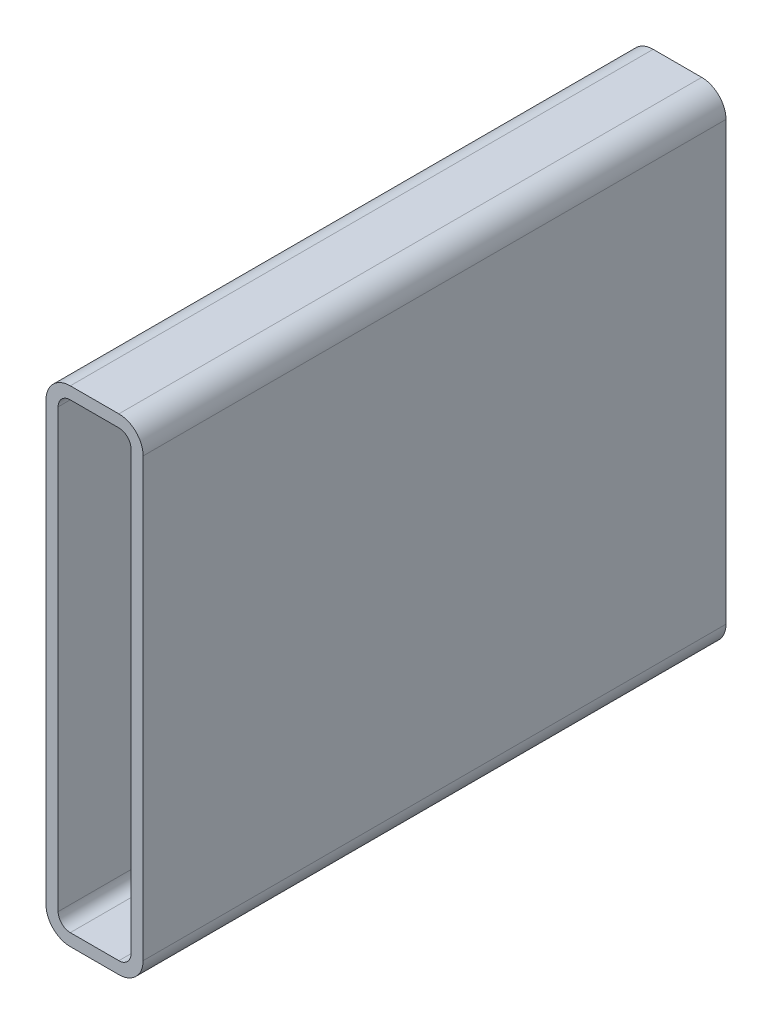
ISO-10303-21;
HEADER;
FILE_DESCRIPTION(('STEP AP214'),'2;1');
FILE_NAME('part.step','',(''),(''),'','','');
FILE_SCHEMA(('AUTOMOTIVE_DESIGN { 1 0 10303 214 1 1 1 1 }'));
ENDSEC;
DATA;
#1=APPLICATION_CONTEXT('core data for automotive mechanical design processes');
#2=APPLICATION_PROTOCOL_DEFINITION('international standard','automotive_design',2000,#1);
#3=PRODUCT_CONTEXT('',#1,'mechanical');
#4=PRODUCT('Part','Part','',(#3));
#5=PRODUCT_RELATED_PRODUCT_CATEGORY('part','',(#4));
#6=PRODUCT_DEFINITION_FORMATION('','',#4);
#7=PRODUCT_DEFINITION_CONTEXT('part definition',#1,'design');
#8=PRODUCT_DEFINITION('design','',#6,#7);
#9=PRODUCT_DEFINITION_SHAPE('','',#8);
#10=(LENGTH_UNIT() NAMED_UNIT(*) SI_UNIT(.MILLI.,.METRE.));
#11=(NAMED_UNIT(*) PLANE_ANGLE_UNIT() SI_UNIT($,.RADIAN.));
#12=(NAMED_UNIT(*) SI_UNIT($,.STERADIAN.) SOLID_ANGLE_UNIT());
#13=UNCERTAINTY_MEASURE_WITH_UNIT(LENGTH_MEASURE(1.E-05),#10,'distance_accuracy_value','');
#14=(GEOMETRIC_REPRESENTATION_CONTEXT(3) GLOBAL_UNCERTAINTY_ASSIGNED_CONTEXT((#13)) GLOBAL_UNIT_ASSIGNED_CONTEXT((#10,
#11,#12)) REPRESENTATION_CONTEXT('',''));
#15=CARTESIAN_POINT('',(0.,0.,0.));
#16=DIRECTION('',(0.,0.,1.));
#17=DIRECTION('',(1.,0.,0.));
#18=AXIS2_PLACEMENT_3D('',#15,#16,#17);
#19=CARTESIAN_POINT('',(12.7,241.3,304.8));
#20=DIRECTION('',(0.,0.,1.));
#21=DIRECTION('',(1.,0.,0.));
#22=AXIS2_PLACEMENT_3D('',#19,#20,#21);
#23=PLANE('',#22);
#24=CARTESIAN_POINT('',(12.7,241.3,304.8));
#25=DIRECTION('',(0.,0.,1.));
#26=DIRECTION('',(1.,0.,0.));
#27=AXIS2_PLACEMENT_3D('',#24,#25,#26);
#28=CIRCLE('',#27,12.7);
#29=CARTESIAN_POINT('',(12.7,254.,304.8));
#30=VERTEX_POINT('',#29);
#31=CARTESIAN_POINT('',(0.,241.3,304.8));
#32=VERTEX_POINT('',#31);
#33=EDGE_CURVE('E211',#30,#32,#28,.T.);
#34=ORIENTED_EDGE('',*,*,#33,.T.);
#35=DIRECTION('',(0.,-1.,0.));
#36=VECTOR('',#35,1.);
#37=CARTESIAN_POINT('',(0.,12.7,304.8));
#38=LINE('',#37,#36);
#39=CARTESIAN_POINT('',(0.,12.7,304.8));
#40=VERTEX_POINT('',#39);
#41=EDGE_CURVE('E214',#32,#40,#38,.T.);
#42=ORIENTED_EDGE('',*,*,#41,.T.);
#43=CARTESIAN_POINT('',(12.7,12.7,304.8));
#44=DIRECTION('',(0.,0.,1.));
#45=DIRECTION('',(1.,0.,0.));
#46=AXIS2_PLACEMENT_3D('',#43,#44,#45);
#47=CIRCLE('',#46,12.7);
#48=CARTESIAN_POINT('',(12.7,0.,304.8));
#49=VERTEX_POINT('',#48);
#50=EDGE_CURVE('E217',#40,#49,#47,.T.);
#51=ORIENTED_EDGE('',*,*,#50,.T.);
#52=DIRECTION('',(1.,0.,0.));
#53=VECTOR('',#52,1.);
#54=CARTESIAN_POINT('',(38.1,0.,304.8));
#55=LINE('',#54,#53);
#56=CARTESIAN_POINT('',(38.1,0.,304.8));
#57=VERTEX_POINT('',#56);
#58=EDGE_CURVE('E219',#49,#57,#55,.T.);
#59=ORIENTED_EDGE('',*,*,#58,.T.);
#60=CARTESIAN_POINT('',(38.1,12.7,304.8));
#61=DIRECTION('',(0.,0.,1.));
#62=DIRECTION('',(1.,0.,0.));
#63=AXIS2_PLACEMENT_3D('',#60,#61,#62);
#64=CIRCLE('',#63,12.7);
#65=CARTESIAN_POINT('',(50.8,12.7,304.8));
#66=VERTEX_POINT('',#65);
#67=EDGE_CURVE('E221',#57,#66,#64,.T.);
#68=ORIENTED_EDGE('',*,*,#67,.T.);
#69=DIRECTION('',(0.,1.,0.));
#70=VECTOR('',#69,1.);
#71=CARTESIAN_POINT('',(50.8,241.3,304.8));
#72=LINE('',#71,#70);
#73=CARTESIAN_POINT('',(50.8,241.3,304.8));
#74=VERTEX_POINT('',#73);
#75=EDGE_CURVE('E223',#66,#74,#72,.T.);
#76=ORIENTED_EDGE('',*,*,#75,.T.);
#77=CARTESIAN_POINT('',(38.1,241.3,304.8));
#78=DIRECTION('',(0.,0.,1.));
#79=DIRECTION('',(1.,0.,0.));
#80=AXIS2_PLACEMENT_3D('',#77,#78,#79);
#81=CIRCLE('',#80,12.7);
#82=CARTESIAN_POINT('',(38.1,254.,304.8));
#83=VERTEX_POINT('',#82);
#84=EDGE_CURVE('E225',#74,#83,#81,.T.);
#85=ORIENTED_EDGE('',*,*,#84,.T.);
#86=DIRECTION('',(-1.,0.,0.));
#87=VECTOR('',#86,1.);
#88=CARTESIAN_POINT('',(12.7,254.,304.8));
#89=LINE('',#88,#87);
#90=EDGE_CURVE('E227',#83,#30,#89,.T.);
#91=ORIENTED_EDGE('',*,*,#90,.T.);
#92=EDGE_LOOP('',(#34,#42,#51,#59,#68,#76,#85,#91));
#93=FACE_BOUND('',#92,.T.);
#94=DIRECTION('',(0.,-1.,0.));
#95=VECTOR('',#94,1.);
#96=CARTESIAN_POINT('',(6.35,12.7,304.8));
#97=LINE('',#96,#95);
#98=CARTESIAN_POINT('',(6.35,241.3,304.8));
#99=VERTEX_POINT('',#98);
#100=CARTESIAN_POINT('',(6.35,12.7,304.8));
#101=VERTEX_POINT('',#100);
#102=EDGE_CURVE('E154',#99,#101,#97,.T.);
#103=ORIENTED_EDGE('',*,*,#102,.F.);
#104=CARTESIAN_POINT('',(12.7,241.3,304.8));
#105=DIRECTION('',(0.,0.,1.));
#106=DIRECTION('',(1.,0.,0.));
#107=AXIS2_PLACEMENT_3D('',#104,#105,#106);
#108=CIRCLE('',#107,6.35);
#109=CARTESIAN_POINT('',(12.7,247.65,304.8));
#110=VERTEX_POINT('',#109);
#111=EDGE_CURVE('E146',#110,#99,#108,.T.);
#112=ORIENTED_EDGE('',*,*,#111,.F.);
#113=DIRECTION('',(-1.,0.,0.));
#114=VECTOR('',#113,1.);
#115=CARTESIAN_POINT('',(12.7,247.65,304.8));
#116=LINE('',#115,#114);
#117=CARTESIAN_POINT('',(38.1,247.65,304.8));
#118=VERTEX_POINT('',#117);
#119=EDGE_CURVE('E179',#118,#110,#116,.T.);
#120=ORIENTED_EDGE('',*,*,#119,.F.);
#121=CARTESIAN_POINT('',(38.1,241.3,304.8));
#122=DIRECTION('',(0.,0.,1.));
#123=DIRECTION('',(1.,0.,0.));
#124=AXIS2_PLACEMENT_3D('',#121,#122,#123);
#125=CIRCLE('',#124,6.35);
#126=CARTESIAN_POINT('',(44.45,241.3,304.8));
#127=VERTEX_POINT('',#126);
#128=EDGE_CURVE('E177',#127,#118,#125,.T.);
#129=ORIENTED_EDGE('',*,*,#128,.F.);
#130=DIRECTION('',(0.,1.,0.));
#131=VECTOR('',#130,1.);
#132=CARTESIAN_POINT('',(44.45,241.3,304.8));
#133=LINE('',#132,#131);
#134=CARTESIAN_POINT('',(44.45,12.7,304.8));
#135=VERTEX_POINT('',#134);
#136=EDGE_CURVE('E175',#135,#127,#133,.T.);
#137=ORIENTED_EDGE('',*,*,#136,.F.);
#138=CARTESIAN_POINT('',(38.1,12.7,304.8));
#139=DIRECTION('',(0.,0.,1.));
#140=DIRECTION('',(1.,0.,0.));
#141=AXIS2_PLACEMENT_3D('',#138,#139,#140);
#142=CIRCLE('',#141,6.35);
#143=CARTESIAN_POINT('',(38.1,6.35,304.8));
#144=VERTEX_POINT('',#143);
#145=EDGE_CURVE('E173',#144,#135,#142,.T.);
#146=ORIENTED_EDGE('',*,*,#145,.F.);
#147=DIRECTION('',(1.,0.,0.));
#148=VECTOR('',#147,1.);
#149=CARTESIAN_POINT('',(38.1,6.35,304.8));
#150=LINE('',#149,#148);
#151=CARTESIAN_POINT('',(12.7,6.35,304.8));
#152=VERTEX_POINT('',#151);
#153=EDGE_CURVE('E169',#152,#144,#150,.T.);
#154=ORIENTED_EDGE('',*,*,#153,.F.);
#155=CARTESIAN_POINT('',(12.7,12.7,304.8));
#156=DIRECTION('',(0.,0.,1.));
#157=DIRECTION('',(1.,0.,0.));
#158=AXIS2_PLACEMENT_3D('',#155,#156,#157);
#159=CIRCLE('',#158,6.35);
#160=EDGE_CURVE('E167',#101,#152,#159,.T.);
#161=ORIENTED_EDGE('',*,*,#160,.F.);
#162=EDGE_LOOP('',(#103,#112,#120,#129,#137,#146,#154,#161));
#163=FACE_BOUND('',#162,.T.);
#164=ADVANCED_FACE('F33',(#93,#163),#23,.T.);
#165=CARTESIAN_POINT('',(12.7,241.3,0.));
#166=DIRECTION('',(0.,0.,1.));
#167=DIRECTION('',(1.,0.,0.));
#168=AXIS2_PLACEMENT_3D('',#165,#166,#167);
#169=PLANE('',#168);
#170=CARTESIAN_POINT('',(12.7,241.3,0.));
#171=DIRECTION('',(0.,0.,1.));
#172=DIRECTION('',(1.,0.,0.));
#173=AXIS2_PLACEMENT_3D('',#170,#171,#172);
#174=CIRCLE('',#173,12.7);
#175=CARTESIAN_POINT('',(12.7,254.,0.));
#176=VERTEX_POINT('',#175);
#177=CARTESIAN_POINT('',(0.,241.3,0.));
#178=VERTEX_POINT('',#177);
#179=EDGE_CURVE('E162',#176,#178,#174,.T.);
#180=ORIENTED_EDGE('',*,*,#179,.F.);
#181=DIRECTION('',(-1.,0.,0.));
#182=VECTOR('',#181,1.);
#183=CARTESIAN_POINT('',(12.7,254.,0.));
#184=LINE('',#183,#182);
#185=CARTESIAN_POINT('',(38.1,254.,0.));
#186=VERTEX_POINT('',#185);
#187=EDGE_CURVE('E215',#186,#176,#184,.T.);
#188=ORIENTED_EDGE('',*,*,#187,.F.);
#189=CARTESIAN_POINT('',(38.1,241.3,0.));
#190=DIRECTION('',(0.,0.,1.));
#191=DIRECTION('',(1.,0.,0.));
#192=AXIS2_PLACEMENT_3D('',#189,#190,#191);
#193=CIRCLE('',#192,12.7);
#194=CARTESIAN_POINT('',(50.8,241.3,0.));
#195=VERTEX_POINT('',#194);
#196=EDGE_CURVE('E242',#195,#186,#193,.T.);
#197=ORIENTED_EDGE('',*,*,#196,.F.);
#198=DIRECTION('',(0.,1.,0.));
#199=VECTOR('',#198,1.);
#200=CARTESIAN_POINT('',(50.8,241.3,0.));
#201=LINE('',#200,#199);
#202=CARTESIAN_POINT('',(50.8,12.7,0.));
#203=VERTEX_POINT('',#202);
#204=EDGE_CURVE('E240',#203,#195,#201,.T.);
#205=ORIENTED_EDGE('',*,*,#204,.F.);
#206=CARTESIAN_POINT('',(38.1,12.7,0.));
#207=DIRECTION('',(0.,0.,1.));
#208=DIRECTION('',(1.,0.,0.));
#209=AXIS2_PLACEMENT_3D('',#206,#207,#208);
#210=CIRCLE('',#209,12.7);
#211=CARTESIAN_POINT('',(38.1,0.,0.));
#212=VERTEX_POINT('',#211);
#213=EDGE_CURVE('E238',#212,#203,#210,.T.);
#214=ORIENTED_EDGE('',*,*,#213,.F.);
#215=DIRECTION('',(1.,0.,0.));
#216=VECTOR('',#215,1.);
#217=CARTESIAN_POINT('',(38.1,0.,0.));
#218=LINE('',#217,#216);
#219=CARTESIAN_POINT('',(12.7,0.,0.));
#220=VERTEX_POINT('',#219);
#221=EDGE_CURVE('E236',#220,#212,#218,.T.);
#222=ORIENTED_EDGE('',*,*,#221,.F.);
#223=CARTESIAN_POINT('',(12.7,12.7,0.));
#224=DIRECTION('',(0.,0.,1.));
#225=DIRECTION('',(1.,0.,0.));
#226=AXIS2_PLACEMENT_3D('',#223,#224,#225);
#227=CIRCLE('',#226,12.7);
#228=CARTESIAN_POINT('',(0.,12.7,0.));
#229=VERTEX_POINT('',#228);
#230=EDGE_CURVE('E234',#229,#220,#227,.T.);
#231=ORIENTED_EDGE('',*,*,#230,.F.);
#232=DIRECTION('',(0.,-1.,0.));
#233=VECTOR('',#232,1.);
#234=CARTESIAN_POINT('',(0.,12.7,0.));
#235=LINE('',#234,#233);
#236=EDGE_CURVE('E232',#178,#229,#235,.T.);
#237=ORIENTED_EDGE('',*,*,#236,.F.);
#238=EDGE_LOOP('',(#180,#188,#197,#205,#214,#222,#231,#237));
#239=FACE_BOUND('',#238,.T.);
#240=CARTESIAN_POINT('',(12.7,241.3,0.));
#241=DIRECTION('',(0.,0.,1.));
#242=DIRECTION('',(1.,0.,0.));
#243=AXIS2_PLACEMENT_3D('',#240,#241,#242);
#244=CIRCLE('',#243,6.35);
#245=CARTESIAN_POINT('',(12.7,247.65,0.));
#246=VERTEX_POINT('',#245);
#247=CARTESIAN_POINT('',(6.35,241.3,0.));
#248=VERTEX_POINT('',#247);
#249=EDGE_CURVE('E56',#246,#248,#244,.T.);
#250=ORIENTED_EDGE('',*,*,#249,.T.);
#251=DIRECTION('',(0.,-1.,0.));
#252=VECTOR('',#251,1.);
#253=CARTESIAN_POINT('',(6.35,12.7,0.));
#254=LINE('',#253,#252);
#255=CARTESIAN_POINT('',(6.35,12.7,0.));
#256=VERTEX_POINT('',#255);
#257=EDGE_CURVE('E161',#248,#256,#254,.T.);
#258=ORIENTED_EDGE('',*,*,#257,.T.);
#259=CARTESIAN_POINT('',(12.7,12.7,0.));
#260=DIRECTION('',(0.,0.,1.));
#261=DIRECTION('',(1.,0.,0.));
#262=AXIS2_PLACEMENT_3D('',#259,#260,#261);
#263=CIRCLE('',#262,6.35);
#264=CARTESIAN_POINT('',(12.7,6.35,0.));
#265=VERTEX_POINT('',#264);
#266=EDGE_CURVE('E183',#256,#265,#263,.T.);
#267=ORIENTED_EDGE('',*,*,#266,.T.);
#268=DIRECTION('',(1.,0.,0.));
#269=VECTOR('',#268,1.);
#270=CARTESIAN_POINT('',(38.1,6.35,0.));
#271=LINE('',#270,#269);
#272=CARTESIAN_POINT('',(38.1,6.35,0.));
#273=VERTEX_POINT('',#272);
#274=EDGE_CURVE('E186',#265,#273,#271,.T.);
#275=ORIENTED_EDGE('',*,*,#274,.T.);
#276=CARTESIAN_POINT('',(38.1,12.7,0.));
#277=DIRECTION('',(0.,0.,1.));
#278=DIRECTION('',(1.,0.,0.));
#279=AXIS2_PLACEMENT_3D('',#276,#277,#278);
#280=CIRCLE('',#279,6.35);
#281=CARTESIAN_POINT('',(44.45,12.7,0.));
#282=VERTEX_POINT('',#281);
#283=EDGE_CURVE('E189',#273,#282,#280,.T.);
#284=ORIENTED_EDGE('',*,*,#283,.T.);
#285=DIRECTION('',(0.,1.,0.));
#286=VECTOR('',#285,1.);
#287=CARTESIAN_POINT('',(44.45,241.3,0.));
#288=LINE('',#287,#286);
#289=CARTESIAN_POINT('',(44.45,241.3,0.));
#290=VERTEX_POINT('',#289);
#291=EDGE_CURVE('E192',#282,#290,#288,.T.);
#292=ORIENTED_EDGE('',*,*,#291,.T.);
#293=CARTESIAN_POINT('',(38.1,241.3,0.));
#294=DIRECTION('',(0.,0.,1.));
#295=DIRECTION('',(1.,0.,0.));
#296=AXIS2_PLACEMENT_3D('',#293,#294,#295);
#297=CIRCLE('',#296,6.35);
#298=CARTESIAN_POINT('',(38.1,247.65,0.));
#299=VERTEX_POINT('',#298);
#300=EDGE_CURVE('E195',#290,#299,#297,.T.);
#301=ORIENTED_EDGE('',*,*,#300,.T.);
#302=DIRECTION('',(-1.,0.,0.));
#303=VECTOR('',#302,1.);
#304=CARTESIAN_POINT('',(12.7,247.65,0.));
#305=LINE('',#304,#303);
#306=EDGE_CURVE('E155',#299,#246,#305,.T.);
#307=ORIENTED_EDGE('',*,*,#306,.T.);
#308=EDGE_LOOP('',(#250,#258,#267,#275,#284,#292,#301,#307));
#309=FACE_BOUND('',#308,.T.);
#310=ADVANCED_FACE('F272',(#239,#309),#169,.F.);
#311=CARTESIAN_POINT('',(12.7,241.3,304.8));
#312=DIRECTION('',(0.,0.,-1.));
#313=DIRECTION('',(-1.,0.,0.));
#314=AXIS2_PLACEMENT_3D('',#311,#312,#313);
#315=CYLINDRICAL_SURFACE('',#314,12.7);
#316=ORIENTED_EDGE('',*,*,#179,.T.);
#317=DIRECTION('',(0.,0.,-1.));
#318=VECTOR('',#317,1.);
#319=CARTESIAN_POINT('',(0.,241.3,304.8));
#320=LINE('',#319,#318);
#321=EDGE_CURVE('E11',#32,#178,#320,.T.);
#322=ORIENTED_EDGE('',*,*,#321,.F.);
#323=ORIENTED_EDGE('',*,*,#33,.F.);
#324=DIRECTION('',(0.,0.,-1.));
#325=VECTOR('',#324,1.);
#326=CARTESIAN_POINT('',(12.7,254.,304.8));
#327=LINE('',#326,#325);
#328=EDGE_CURVE('E229',#30,#176,#327,.T.);
#329=ORIENTED_EDGE('',*,*,#328,.T.);
#330=EDGE_LOOP('',(#316,#322,#323,#329));
#331=FACE_BOUND('',#330,.T.);
#332=ADVANCED_FACE('F35',(#331),#315,.T.);
#333=CARTESIAN_POINT('',(0.,12.7,304.8));
#334=DIRECTION('',(1.,0.,0.));
#335=DIRECTION('',(0.,0.,-1.));
#336=AXIS2_PLACEMENT_3D('',#333,#334,#335);
#337=PLANE('',#336);
#338=ORIENTED_EDGE('',*,*,#236,.T.);
#339=DIRECTION('',(0.,0.,-1.));
#340=VECTOR('',#339,1.);
#341=CARTESIAN_POINT('',(0.,12.7,304.8));
#342=LINE('',#341,#340);
#343=EDGE_CURVE('E41',#40,#229,#342,.T.);
#344=ORIENTED_EDGE('',*,*,#343,.F.);
#345=ORIENTED_EDGE('',*,*,#41,.F.);
#346=ORIENTED_EDGE('',*,*,#321,.T.);
#347=EDGE_LOOP('',(#338,#344,#345,#346));
#348=FACE_BOUND('',#347,.T.);
#349=ADVANCED_FACE('F289',(#348),#337,.F.);
#350=CARTESIAN_POINT('',(12.7,12.7,304.8));
#351=DIRECTION('',(0.,0.,-1.));
#352=DIRECTION('',(-1.,0.,0.));
#353=AXIS2_PLACEMENT_3D('',#350,#351,#352);
#354=CYLINDRICAL_SURFACE('',#353,12.7);
#355=ORIENTED_EDGE('',*,*,#230,.T.);
#356=DIRECTION('',(0.,0.,-1.));
#357=VECTOR('',#356,1.);
#358=CARTESIAN_POINT('',(12.7,0.,304.8));
#359=LINE('',#358,#357);
#360=EDGE_CURVE('E259',#49,#220,#359,.T.);
#361=ORIENTED_EDGE('',*,*,#360,.F.);
#362=ORIENTED_EDGE('',*,*,#50,.F.);
#363=ORIENTED_EDGE('',*,*,#343,.T.);
#364=EDGE_LOOP('',(#355,#361,#362,#363));
#365=FACE_BOUND('',#364,.T.);
#366=ADVANCED_FACE('F266',(#365),#354,.T.);
#367=CARTESIAN_POINT('',(38.1,0.,304.8));
#368=DIRECTION('',(0.,1.,0.));
#369=DIRECTION('',(0.,0.,1.));
#370=AXIS2_PLACEMENT_3D('',#367,#368,#369);
#371=PLANE('',#370);
#372=ORIENTED_EDGE('',*,*,#221,.T.);
#373=DIRECTION('',(0.,0.,-1.));
#374=VECTOR('',#373,1.);
#375=CARTESIAN_POINT('',(38.1,0.,304.8));
#376=LINE('',#375,#374);
#377=EDGE_CURVE('E256',#57,#212,#376,.T.);
#378=ORIENTED_EDGE('',*,*,#377,.F.);
#379=ORIENTED_EDGE('',*,*,#58,.F.);
#380=ORIENTED_EDGE('',*,*,#360,.T.);
#381=EDGE_LOOP('',(#372,#378,#379,#380));
#382=FACE_BOUND('',#381,.T.);
#383=ADVANCED_FACE('F278',(#382),#371,.F.);
#384=CARTESIAN_POINT('',(38.1,12.7,304.8));
#385=DIRECTION('',(0.,0.,-1.));
#386=DIRECTION('',(-1.,0.,0.));
#387=AXIS2_PLACEMENT_3D('',#384,#385,#386);
#388=CYLINDRICAL_SURFACE('',#387,12.7);
#389=ORIENTED_EDGE('',*,*,#213,.T.);
#390=DIRECTION('',(0.,0.,-1.));
#391=VECTOR('',#390,1.);
#392=CARTESIAN_POINT('',(50.8,12.7,304.8));
#393=LINE('',#392,#391);
#394=EDGE_CURVE('E253',#66,#203,#393,.T.);
#395=ORIENTED_EDGE('',*,*,#394,.F.);
#396=ORIENTED_EDGE('',*,*,#67,.F.);
#397=ORIENTED_EDGE('',*,*,#377,.T.);
#398=EDGE_LOOP('',(#389,#395,#396,#397));
#399=FACE_BOUND('',#398,.T.);
#400=ADVANCED_FACE('F282',(#399),#388,.T.);
#401=CARTESIAN_POINT('',(50.8,241.3,304.8));
#402=DIRECTION('',(-1.,0.,0.));
#403=DIRECTION('',(0.,0.,1.));
#404=AXIS2_PLACEMENT_3D('',#401,#402,#403);
#405=PLANE('',#404);
#406=ORIENTED_EDGE('',*,*,#204,.T.);
#407=DIRECTION('',(0.,0.,-1.));
#408=VECTOR('',#407,1.);
#409=CARTESIAN_POINT('',(50.8,241.3,304.8));
#410=LINE('',#409,#408);
#411=EDGE_CURVE('E250',#74,#195,#410,.T.);
#412=ORIENTED_EDGE('',*,*,#411,.F.);
#413=ORIENTED_EDGE('',*,*,#75,.F.);
#414=ORIENTED_EDGE('',*,*,#394,.T.);
#415=EDGE_LOOP('',(#406,#412,#413,#414));
#416=FACE_BOUND('',#415,.T.);
#417=ADVANCED_FACE('F302',(#416),#405,.F.);
#418=CARTESIAN_POINT('',(38.1,241.3,304.8));
#419=DIRECTION('',(0.,0.,-1.));
#420=DIRECTION('',(-1.,0.,0.));
#421=AXIS2_PLACEMENT_3D('',#418,#419,#420);
#422=CYLINDRICAL_SURFACE('',#421,12.7);
#423=ORIENTED_EDGE('',*,*,#196,.T.);
#424=DIRECTION('',(0.,0.,-1.));
#425=VECTOR('',#424,1.);
#426=CARTESIAN_POINT('',(38.1,254.,304.8));
#427=LINE('',#426,#425);
#428=EDGE_CURVE('E247',#83,#186,#427,.T.);
#429=ORIENTED_EDGE('',*,*,#428,.F.);
#430=ORIENTED_EDGE('',*,*,#84,.F.);
#431=ORIENTED_EDGE('',*,*,#411,.T.);
#432=EDGE_LOOP('',(#423,#429,#430,#431));
#433=FACE_BOUND('',#432,.T.);
#434=ADVANCED_FACE('F300',(#433),#422,.T.);
#435=CARTESIAN_POINT('',(12.7,254.,304.8));
#436=DIRECTION('',(0.,-1.,0.));
#437=DIRECTION('',(0.,0.,-1.));
#438=AXIS2_PLACEMENT_3D('',#435,#436,#437);
#439=PLANE('',#438);
#440=ORIENTED_EDGE('',*,*,#187,.T.);
#441=ORIENTED_EDGE('',*,*,#328,.F.);
#442=ORIENTED_EDGE('',*,*,#90,.F.);
#443=ORIENTED_EDGE('',*,*,#428,.T.);
#444=EDGE_LOOP('',(#440,#441,#442,#443));
#445=FACE_BOUND('',#444,.T.);
#446=ADVANCED_FACE('F295',(#445),#439,.F.);
#447=CARTESIAN_POINT('',(12.7,241.3,304.8));
#448=DIRECTION('',(0.,0.,-1.));
#449=DIRECTION('',(-1.,0.,0.));
#450=AXIS2_PLACEMENT_3D('',#447,#448,#449);
#451=CYLINDRICAL_SURFACE('',#450,6.35);
#452=ORIENTED_EDGE('',*,*,#249,.F.);
#453=DIRECTION('',(0.,0.,-1.));
#454=VECTOR('',#453,1.);
#455=CARTESIAN_POINT('',(12.7,247.65,304.8));
#456=LINE('',#455,#454);
#457=EDGE_CURVE('E150',#110,#246,#456,.T.);
#458=ORIENTED_EDGE('',*,*,#457,.F.);
#459=ORIENTED_EDGE('',*,*,#111,.T.);
#460=DIRECTION('',(0.,0.,-1.));
#461=VECTOR('',#460,1.);
#462=CARTESIAN_POINT('',(6.35,241.3,304.8));
#463=LINE('',#462,#461);
#464=EDGE_CURVE('E149',#99,#248,#463,.T.);
#465=ORIENTED_EDGE('',*,*,#464,.T.);
#466=EDGE_LOOP('',(#452,#458,#459,#465));
#467=FACE_BOUND('',#466,.T.);
#468=ADVANCED_FACE('F148',(#467),#451,.F.);
#469=CARTESIAN_POINT('',(6.35,12.7,304.8));
#470=DIRECTION('',(1.,0.,0.));
#471=DIRECTION('',(0.,0.,-1.));
#472=AXIS2_PLACEMENT_3D('',#469,#470,#471);
#473=PLANE('',#472);
#474=ORIENTED_EDGE('',*,*,#257,.F.);
#475=ORIENTED_EDGE('',*,*,#464,.F.);
#476=ORIENTED_EDGE('',*,*,#102,.T.);
#477=DIRECTION('',(0.,0.,-1.));
#478=VECTOR('',#477,1.);
#479=CARTESIAN_POINT('',(6.35,12.7,304.8));
#480=LINE('',#479,#478);
#481=EDGE_CURVE('E163',#101,#256,#480,.T.);
#482=ORIENTED_EDGE('',*,*,#481,.T.);
#483=EDGE_LOOP('',(#474,#475,#476,#482));
#484=FACE_BOUND('',#483,.T.);
#485=ADVANCED_FACE('F158',(#484),#473,.T.);
#486=CARTESIAN_POINT('',(12.7,12.7,304.8));
#487=DIRECTION('',(0.,0.,-1.));
#488=DIRECTION('',(-1.,0.,0.));
#489=AXIS2_PLACEMENT_3D('',#486,#487,#488);
#490=CYLINDRICAL_SURFACE('',#489,6.35);
#491=ORIENTED_EDGE('',*,*,#266,.F.);
#492=ORIENTED_EDGE('',*,*,#481,.F.);
#493=ORIENTED_EDGE('',*,*,#160,.T.);
#494=DIRECTION('',(0.,0.,-1.));
#495=VECTOR('',#494,1.);
#496=CARTESIAN_POINT('',(12.7,6.35,304.8));
#497=LINE('',#496,#495);
#498=EDGE_CURVE('E208',#152,#265,#497,.T.);
#499=ORIENTED_EDGE('',*,*,#498,.T.);
#500=EDGE_LOOP('',(#491,#492,#493,#499));
#501=FACE_BOUND('',#500,.T.);
#502=ADVANCED_FACE('F327',(#501),#490,.F.);
#503=CARTESIAN_POINT('',(38.1,6.35,304.8));
#504=DIRECTION('',(0.,1.,0.));
#505=DIRECTION('',(0.,0.,1.));
#506=AXIS2_PLACEMENT_3D('',#503,#504,#505);
#507=PLANE('',#506);
#508=ORIENTED_EDGE('',*,*,#274,.F.);
#509=ORIENTED_EDGE('',*,*,#498,.F.);
#510=ORIENTED_EDGE('',*,*,#153,.T.);
#511=DIRECTION('',(0.,0.,-1.));
#512=VECTOR('',#511,1.);
#513=CARTESIAN_POINT('',(38.1,6.35,304.8));
#514=LINE('',#513,#512);
#515=EDGE_CURVE('E206',#144,#273,#514,.T.);
#516=ORIENTED_EDGE('',*,*,#515,.T.);
#517=EDGE_LOOP('',(#508,#509,#510,#516));
#518=FACE_BOUND('',#517,.T.);
#519=ADVANCED_FACE('F331',(#518),#507,.T.);
#520=CARTESIAN_POINT('',(38.1,12.7,304.8));
#521=DIRECTION('',(0.,0.,-1.));
#522=DIRECTION('',(-1.,0.,0.));
#523=AXIS2_PLACEMENT_3D('',#520,#521,#522);
#524=CYLINDRICAL_SURFACE('',#523,6.35);
#525=ORIENTED_EDGE('',*,*,#283,.F.);
#526=ORIENTED_EDGE('',*,*,#515,.F.);
#527=ORIENTED_EDGE('',*,*,#145,.T.);
#528=DIRECTION('',(0.,0.,-1.));
#529=VECTOR('',#528,1.);
#530=CARTESIAN_POINT('',(44.45,12.7,304.8));
#531=LINE('',#530,#529);
#532=EDGE_CURVE('E204',#135,#282,#531,.T.);
#533=ORIENTED_EDGE('',*,*,#532,.T.);
#534=EDGE_LOOP('',(#525,#526,#527,#533));
#535=FACE_BOUND('',#534,.T.);
#536=ADVANCED_FACE('F337',(#535),#524,.F.);
#537=CARTESIAN_POINT('',(44.45,241.3,304.8));
#538=DIRECTION('',(-1.,0.,0.));
#539=DIRECTION('',(0.,0.,1.));
#540=AXIS2_PLACEMENT_3D('',#537,#538,#539);
#541=PLANE('',#540);
#542=ORIENTED_EDGE('',*,*,#291,.F.);
#543=ORIENTED_EDGE('',*,*,#532,.F.);
#544=ORIENTED_EDGE('',*,*,#136,.T.);
#545=DIRECTION('',(0.,0.,-1.));
#546=VECTOR('',#545,1.);
#547=CARTESIAN_POINT('',(44.45,241.3,304.8));
#548=LINE('',#547,#546);
#549=EDGE_CURVE('E202',#127,#290,#548,.T.);
#550=ORIENTED_EDGE('',*,*,#549,.T.);
#551=EDGE_LOOP('',(#542,#543,#544,#550));
#552=FACE_BOUND('',#551,.T.);
#553=ADVANCED_FACE('F341',(#552),#541,.T.);
#554=CARTESIAN_POINT('',(38.1,241.3,304.8));
#555=DIRECTION('',(0.,0.,-1.));
#556=DIRECTION('',(-1.,0.,0.));
#557=AXIS2_PLACEMENT_3D('',#554,#555,#556);
#558=CYLINDRICAL_SURFACE('',#557,6.35);
#559=ORIENTED_EDGE('',*,*,#300,.F.);
#560=ORIENTED_EDGE('',*,*,#549,.F.);
#561=ORIENTED_EDGE('',*,*,#128,.T.);
#562=DIRECTION('',(0.,0.,-1.));
#563=VECTOR('',#562,1.);
#564=CARTESIAN_POINT('',(38.1,247.65,304.8));
#565=LINE('',#564,#563);
#566=EDGE_CURVE('E48',#118,#299,#565,.T.);
#567=ORIENTED_EDGE('',*,*,#566,.T.);
#568=EDGE_LOOP('',(#559,#560,#561,#567));
#569=FACE_BOUND('',#568,.T.);
#570=ADVANCED_FACE('F345',(#569),#558,.F.);
#571=CARTESIAN_POINT('',(12.7,247.65,304.8));
#572=DIRECTION('',(0.,-1.,0.));
#573=DIRECTION('',(0.,0.,-1.));
#574=AXIS2_PLACEMENT_3D('',#571,#572,#573);
#575=PLANE('',#574);
#576=ORIENTED_EDGE('',*,*,#306,.F.);
#577=ORIENTED_EDGE('',*,*,#566,.F.);
#578=ORIENTED_EDGE('',*,*,#119,.T.);
#579=ORIENTED_EDGE('',*,*,#457,.T.);
#580=EDGE_LOOP('',(#576,#577,#578,#579));
#581=FACE_BOUND('',#580,.T.);
#582=ADVANCED_FACE('F349',(#581),#575,.T.);
#583=CLOSED_SHELL('',(#164,#310,#332,#349,#366,#383,#400,#417,#434,#446,#468,#485,#502,#519,
#536,#553,#570,#582));
#584=MANIFOLD_SOLID_BREP('B2',#583);
#585=ADVANCED_BREP_SHAPE_REPRESENTATION('',(#18,#584),#14);
#586=SHAPE_DEFINITION_REPRESENTATION(#9,#585);
ENDSEC;
END-ISO-10303-21;
